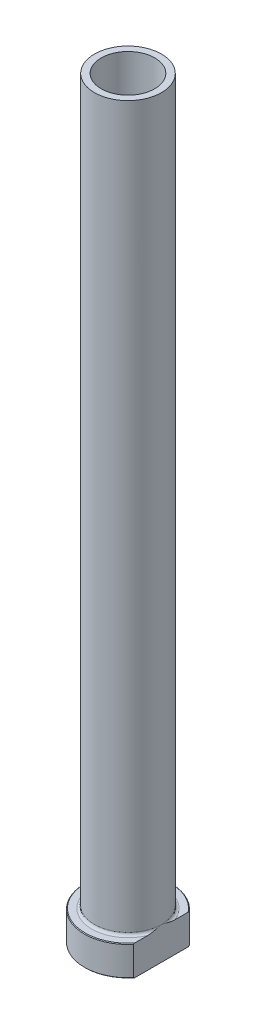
ISO-10303-21;
HEADER;
FILE_DESCRIPTION(('STEP AP214'),'2;1');
FILE_NAME('part.step','',(''),(''),'','','');
FILE_SCHEMA(('AUTOMOTIVE_DESIGN { 1 0 10303 214 1 1 1 1 }'));
ENDSEC;
DATA;
#1=APPLICATION_CONTEXT('core data for automotive mechanical design processes');
#2=APPLICATION_PROTOCOL_DEFINITION('international standard','automotive_design',2000,#1);
#3=PRODUCT_CONTEXT('',#1,'mechanical');
#4=PRODUCT('Part','Part','',(#3));
#5=PRODUCT_RELATED_PRODUCT_CATEGORY('part','',(#4));
#6=PRODUCT_DEFINITION_FORMATION('','',#4);
#7=PRODUCT_DEFINITION_CONTEXT('part definition',#1,'design');
#8=PRODUCT_DEFINITION('design','',#6,#7);
#9=PRODUCT_DEFINITION_SHAPE('','',#8);
#10=(LENGTH_UNIT() NAMED_UNIT(*) SI_UNIT(.MILLI.,.METRE.));
#11=(NAMED_UNIT(*) PLANE_ANGLE_UNIT() SI_UNIT($,.RADIAN.));
#12=(NAMED_UNIT(*) SI_UNIT($,.STERADIAN.) SOLID_ANGLE_UNIT());
#13=UNCERTAINTY_MEASURE_WITH_UNIT(LENGTH_MEASURE(1.E-05),#10,'distance_accuracy_value','');
#14=(GEOMETRIC_REPRESENTATION_CONTEXT(3) GLOBAL_UNCERTAINTY_ASSIGNED_CONTEXT((#13)) GLOBAL_UNIT_ASSIGNED_CONTEXT((#10,
#11,#12)) REPRESENTATION_CONTEXT('',''));
#15=CARTESIAN_POINT('',(0.,0.,0.));
#16=DIRECTION('',(0.,0.,1.));
#17=DIRECTION('',(1.,0.,0.));
#18=AXIS2_PLACEMENT_3D('',#15,#16,#17);
#19=CARTESIAN_POINT('',(0.,92.1876809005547,0.));
#20=DIRECTION('',(0.,1.,0.));
#21=DIRECTION('',(0.,0.,1.));
#22=AXIS2_PLACEMENT_3D('',#19,#20,#21);
#23=CYLINDRICAL_SURFACE('',#22,8.00000000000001);
#24=CARTESIAN_POINT('',(0.,225.,0.));
#25=DIRECTION('',(0.,1.,0.));
#26=DIRECTION('',(0.,0.,1.));
#27=AXIS2_PLACEMENT_3D('',#24,#25,#26);
#28=CIRCLE('',#27,8.00000000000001);
#29=CARTESIAN_POINT('',(0.,225.,8.00000000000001));
#30=VERTEX_POINT('',#29);
#31=EDGE_CURVE('E167',#30,#30,#28,.T.);
#32=ORIENTED_EDGE('',*,*,#31,.T.);
#33=EDGE_LOOP('',(#32));
#34=FACE_BOUND('',#33,.T.);
#35=CARTESIAN_POINT('',(0.,170.,0.));
#36=DIRECTION('',(0.,1.,0.));
#37=DIRECTION('',(0.,0.,1.));
#38=AXIS2_PLACEMENT_3D('',#35,#36,#37);
#39=CIRCLE('',#38,8.00000000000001);
#40=CARTESIAN_POINT('',(0.,170.,8.00000000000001));
#41=VERTEX_POINT('',#40);
#42=EDGE_CURVE('E170',#41,#41,#39,.T.);
#43=ORIENTED_EDGE('',*,*,#42,.F.);
#44=EDGE_LOOP('',(#43));
#45=FACE_BOUND('',#44,.T.);
#46=ADVANCED_FACE('F32',(#34,#45),#23,.F.);
#47=CARTESIAN_POINT('',(-8.00000000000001,225.,0.));
#48=DIRECTION('',(0.,1.,0.));
#49=DIRECTION('',(0.,0.,1.));
#50=AXIS2_PLACEMENT_3D('',#47,#48,#49);
#51=PLANE('',#50);
#52=CARTESIAN_POINT('',(0.,225.,0.));
#53=DIRECTION('',(0.,1.,0.));
#54=DIRECTION('',(0.,0.,1.));
#55=AXIS2_PLACEMENT_3D('',#52,#53,#54);
#56=CIRCLE('',#55,10.);
#57=CARTESIAN_POINT('',(0.,225.,10.));
#58=VERTEX_POINT('',#57);
#59=EDGE_CURVE('E174',#58,#58,#56,.T.);
#60=ORIENTED_EDGE('',*,*,#59,.T.);
#61=EDGE_LOOP('',(#60));
#62=FACE_BOUND('',#61,.T.);
#63=ORIENTED_EDGE('',*,*,#31,.F.);
#64=EDGE_LOOP('',(#63));
#65=FACE_BOUND('',#64,.T.);
#66=ADVANCED_FACE('F157',(#62,#65),#51,.T.);
#67=CARTESIAN_POINT('',(0.,92.1876809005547,0.));
#68=DIRECTION('',(0.,1.,0.));
#69=DIRECTION('',(0.,0.,1.));
#70=AXIS2_PLACEMENT_3D('',#67,#68,#69);
#71=CYLINDRICAL_SURFACE('',#70,10.);
#72=CARTESIAN_POINT('',(0.,9.8,0.));
#73=DIRECTION('',(0.,1.,0.));
#74=DIRECTION('',(0.,0.,1.));
#75=AXIS2_PLACEMENT_3D('',#72,#73,#74);
#76=CIRCLE('',#75,10.);
#77=CARTESIAN_POINT('',(10.,9.8,0.));
#78=VERTEX_POINT('',#77);
#79=EDGE_CURVE('E180',#78,#78,#76,.T.);
#80=ORIENTED_EDGE('',*,*,#79,.T.);
#81=EDGE_LOOP('',(#80));
#82=FACE_BOUND('',#81,.T.);
#83=ORIENTED_EDGE('',*,*,#59,.F.);
#84=EDGE_LOOP('',(#83));
#85=FACE_BOUND('',#84,.T.);
#86=ADVANCED_FACE('F162',(#82,#85),#71,.T.);
#87=CARTESIAN_POINT('',(-9.99999999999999,9.,0.));
#88=DIRECTION('',(0.,1.,0.));
#89=DIRECTION('',(0.,0.,1.));
#90=AXIS2_PLACEMENT_3D('',#87,#88,#89);
#91=PLANE('',#90);
#92=DIRECTION('',(0.,0.,1.));
#93=VECTOR('',#92,1.);
#94=CARTESIAN_POINT('',(10.,9.,0.));
#95=LINE('',#94,#93);
#96=CARTESIAN_POINT('',(10.,9.,-7.98999374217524));
#97=VERTEX_POINT('',#96);
#98=CARTESIAN_POINT('',(10.,9.,-4.07921561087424));
#99=VERTEX_POINT('',#98);
#100=EDGE_CURVE('E54',#97,#99,#95,.T.);
#101=ORIENTED_EDGE('',*,*,#100,.F.);
#102=CARTESIAN_POINT('',(0.,9.,0.));
#103=DIRECTION('',(0.,1.,0.));
#104=DIRECTION('',(0.,0.,1.));
#105=AXIS2_PLACEMENT_3D('',#102,#103,#104);
#106=CIRCLE('',#105,12.8);
#107=CARTESIAN_POINT('',(9.99999999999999,9.,7.98999374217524));
#108=VERTEX_POINT('',#107);
#109=EDGE_CURVE('E186',#97,#108,#106,.T.);
#110=ORIENTED_EDGE('',*,*,#109,.T.);
#111=CARTESIAN_POINT('',(10.,9.,4.07921561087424));
#112=VERTEX_POINT('',#111);
#113=EDGE_CURVE('E134',#112,#108,#95,.T.);
#114=ORIENTED_EDGE('',*,*,#113,.F.);
#115=CARTESIAN_POINT('',(0.,9.,0.));
#116=DIRECTION('',(0.,1.,0.));
#117=DIRECTION('',(0.,0.,1.));
#118=AXIS2_PLACEMENT_3D('',#115,#116,#117);
#119=CIRCLE('',#118,10.8);
#120=EDGE_CURVE('E183',#112,#99,#119,.F.);
#121=ORIENTED_EDGE('',*,*,#120,.T.);
#122=EDGE_LOOP('',(#101,#110,#114,#121));
#123=FACE_BOUND('',#122,.T.);
#124=ADVANCED_FACE('F197',(#123),#91,.T.);
#125=CARTESIAN_POINT('',(0.,92.1876809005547,0.));
#126=DIRECTION('',(0.,1.,0.));
#127=DIRECTION('',(0.,0.,1.));
#128=AXIS2_PLACEMENT_3D('',#125,#126,#127);
#129=CYLINDRICAL_SURFACE('',#128,13.);
#130=DIRECTION('',(0.,-1.,0.));
#131=VECTOR('',#130,1.);
#132=CARTESIAN_POINT('',(9.99999999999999,225.,8.30662386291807));
#133=LINE('',#132,#131);
#134=CARTESIAN_POINT('',(9.99999999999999,8.79999999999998,8.30662386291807));
#135=VERTEX_POINT('',#134);
#136=CARTESIAN_POINT('',(9.99999999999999,0.200000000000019,8.30662386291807));
#137=VERTEX_POINT('',#136);
#138=EDGE_CURVE('E82',#135,#137,#133,.T.);
#139=ORIENTED_EDGE('',*,*,#138,.F.);
#140=CARTESIAN_POINT('',(0.,8.79999999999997,0.));
#141=DIRECTION('',(0.,1.,0.));
#142=DIRECTION('',(0.,0.,1.));
#143=AXIS2_PLACEMENT_3D('',#140,#141,#142);
#144=CIRCLE('',#143,13.);
#145=CARTESIAN_POINT('',(10.,8.79999999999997,-8.30662386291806));
#146=VERTEX_POINT('',#145);
#147=EDGE_CURVE('E95',#135,#146,#144,.F.);
#148=ORIENTED_EDGE('',*,*,#147,.T.);
#149=DIRECTION('',(0.,-1.,0.));
#150=VECTOR('',#149,1.);
#151=CARTESIAN_POINT('',(10.,225.,-8.30662386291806));
#152=LINE('',#151,#150);
#153=CARTESIAN_POINT('',(10.,0.20000000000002,-8.30662386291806));
#154=VERTEX_POINT('',#153);
#155=EDGE_CURVE('E192',#146,#154,#152,.T.);
#156=ORIENTED_EDGE('',*,*,#155,.T.);
#157=CARTESIAN_POINT('',(0.,0.20000000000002,0.));
#158=DIRECTION('',(0.,-1.,0.));
#159=DIRECTION('',(0.,0.,-1.));
#160=AXIS2_PLACEMENT_3D('',#157,#158,#159);
#161=CIRCLE('',#160,13.);
#162=EDGE_CURVE('E98',#154,#137,#161,.F.);
#163=ORIENTED_EDGE('',*,*,#162,.T.);
#164=EDGE_LOOP('',(#139,#148,#156,#163));
#165=FACE_BOUND('',#164,.T.);
#166=ADVANCED_FACE('F190',(#165),#129,.T.);
#167=CARTESIAN_POINT('',(-13.,0.,0.));
#168=DIRECTION('',(0.,-1.,0.));
#169=DIRECTION('',(0.,0.,-1.));
#170=AXIS2_PLACEMENT_3D('',#167,#168,#169);
#171=PLANE('',#170);
#172=CARTESIAN_POINT('',(0.,0.,0.));
#173=DIRECTION('',(0.,-1.,0.));
#174=DIRECTION('',(0.,0.,-1.));
#175=AXIS2_PLACEMENT_3D('',#172,#173,#174);
#176=CIRCLE('',#175,8.74999999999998);
#177=CARTESIAN_POINT('',(0.,0.,-8.74999999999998));
#178=VERTEX_POINT('',#177);
#179=EDGE_CURVE('E40',#178,#178,#176,.F.);
#180=ORIENTED_EDGE('',*,*,#179,.T.);
#181=EDGE_LOOP('',(#180));
#182=FACE_BOUND('',#181,.T.);
#183=DIRECTION('',(0.,0.,-1.));
#184=VECTOR('',#183,1.);
#185=CARTESIAN_POINT('',(9.99999999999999,0.,8.30662386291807));
#186=LINE('',#185,#184);
#187=CARTESIAN_POINT('',(9.99999999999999,0.,7.98999374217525));
#188=VERTEX_POINT('',#187);
#189=CARTESIAN_POINT('',(10.,0.,-7.98999374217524));
#190=VERTEX_POINT('',#189);
#191=EDGE_CURVE('E47',#188,#190,#186,.T.);
#192=ORIENTED_EDGE('',*,*,#191,.F.);
#193=CARTESIAN_POINT('',(0.,0.,0.));
#194=DIRECTION('',(0.,-1.,0.));
#195=DIRECTION('',(0.,0.,-1.));
#196=AXIS2_PLACEMENT_3D('',#193,#194,#195);
#197=CIRCLE('',#196,12.8);
#198=EDGE_CURVE('E92',#188,#190,#197,.T.);
#199=ORIENTED_EDGE('',*,*,#198,.T.);
#200=EDGE_LOOP('',(#192,#199));
#201=FACE_BOUND('',#200,.T.);
#202=ADVANCED_FACE('F91',(#182,#201),#171,.T.);
#203=CARTESIAN_POINT('',(0.,92.1876809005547,0.));
#204=DIRECTION('',(0.,1.,0.));
#205=DIRECTION('',(0.,0.,1.));
#206=AXIS2_PLACEMENT_3D('',#203,#204,#205);
#207=CYLINDRICAL_SURFACE('',#206,8.25);
#208=CARTESIAN_POINT('',(0.,0.499999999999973,0.));
#209=DIRECTION('',(0.,-1.,0.));
#210=DIRECTION('',(0.,0.,-1.));
#211=AXIS2_PLACEMENT_3D('',#208,#209,#210);
#212=CIRCLE('',#211,8.25);
#213=CARTESIAN_POINT('',(0.,0.499999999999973,-8.25));
#214=VERTEX_POINT('',#213);
#215=EDGE_CURVE('E11',#214,#214,#212,.T.);
#216=ORIENTED_EDGE('',*,*,#215,.T.);
#217=EDGE_LOOP('',(#216));
#218=FACE_BOUND('',#217,.T.);
#219=CARTESIAN_POINT('',(0.,158.,0.));
#220=DIRECTION('',(0.,1.,0.));
#221=DIRECTION('',(0.,0.,1.));
#222=AXIS2_PLACEMENT_3D('',#219,#220,#221);
#223=CIRCLE('',#222,8.25000000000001);
#224=CARTESIAN_POINT('',(0.,158.,8.25000000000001));
#225=VERTEX_POINT('',#224);
#226=EDGE_CURVE('E172',#225,#225,#223,.T.);
#227=ORIENTED_EDGE('',*,*,#226,.T.);
#228=EDGE_LOOP('',(#227));
#229=FACE_BOUND('',#228,.T.);
#230=ADVANCED_FACE('F215',(#218,#229),#207,.F.);
#231=CARTESIAN_POINT('',(0.,158.,0.));
#232=DIRECTION('',(0.,-1.,0.));
#233=DIRECTION('',(0.,0.,-1.));
#234=AXIS2_PLACEMENT_3D('',#231,#232,#233);
#235=CONICAL_SURFACE('',#234,8.25000000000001,0.0208303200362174);
#236=ORIENTED_EDGE('',*,*,#42,.T.);
#237=EDGE_LOOP('',(#236));
#238=FACE_BOUND('',#237,.T.);
#239=ORIENTED_EDGE('',*,*,#226,.F.);
#240=EDGE_LOOP('',(#239));
#241=FACE_BOUND('',#240,.T.);
#242=ADVANCED_FACE('F111',(#238,#241),#235,.F.);
#243=CARTESIAN_POINT('',(0.,9.8,0.));
#244=DIRECTION('',(0.,1.,0.));
#245=DIRECTION('',(0.,0.,1.));
#246=AXIS2_PLACEMENT_3D('',#243,#244,#245);
#247=TOROIDAL_SURFACE('',#246,10.8,0.8);
#248=ORIENTED_EDGE('',*,*,#120,.F.);
#249=CARTESIAN_POINT('',(10.,9.8,0.));
#250=CARTESIAN_POINT('',(10.,9.8000010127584,-9.45152350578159E-11));
#251=CARTESIAN_POINT('',(10.,9.80000202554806,3.40325426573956E-07));
#252=CARTESIAN_POINT('',(10.,9.80000393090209,1.31610406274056E-06));
#253=CARTESIAN_POINT('',(10.,9.8000048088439,1.9715863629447E-06));
#254=CARTESIAN_POINT('',(10.,9.80000660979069,3.53741339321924E-06));
#255=CARTESIAN_POINT('',(10.,9.80000751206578,4.47242181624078E-06));
#256=CARTESIAN_POINT('',(10.,9.80000915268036,6.43001227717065E-06));
#257=CARTESIAN_POINT('',(10.,9.80000989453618,7.44984104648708E-06));
#258=CARTESIAN_POINT('',(10.,9.80001258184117,1.13248886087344E-05));
#259=CARTESIAN_POINT('',(10.,9.80001437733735,1.42883369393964E-05));
#260=CARTESIAN_POINT('',(10.,9.80001739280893,2.02176342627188E-05));
#261=CARTESIAN_POINT('',(10.,9.80001864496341,2.31678808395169E-05));
#262=CARTESIAN_POINT('',(10.,9.80002377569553,3.54352080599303E-05));
#263=CARTESIAN_POINT('',(10.,9.8000275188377,4.48168454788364E-05));
#264=CARTESIAN_POINT('',(10.,9.80003314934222,6.2698944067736E-05));
#265=CARTESIAN_POINT('',(10.,9.80003522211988,7.11410842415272E-05));
#266=CARTESIAN_POINT('',(10.,9.80005012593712,0.000133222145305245));
#267=CARTESIAN_POINT('',(10.,9.80006122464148,0.000187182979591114));
#268=CARTESIAN_POINT('',(9.99999999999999,9.80010979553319,0.000399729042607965));
#269=CARTESIAN_POINT('',(9.99999999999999,9.8001563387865,0.000556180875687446));
#270=CARTESIAN_POINT('',(10.,9.80033693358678,0.00117428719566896));
#271=CARTESIAN_POINT('',(10.,9.80046495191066,0.00163717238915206));
#272=CARTESIAN_POINT('',(9.99999999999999,9.80097646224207,0.0034721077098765));
#273=CARTESIAN_POINT('',(9.99999999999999,9.80136744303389,0.0048425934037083));
#274=CARTESIAN_POINT('',(10.,9.80299279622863,0.0105557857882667));
#275=CARTESIAN_POINT('',(10.,9.80421787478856,0.0149004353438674));
#276=CARTESIAN_POINT('',(9.99999999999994,9.82556128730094,0.0905719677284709));
#277=CARTESIAN_POINT('',(9.99999999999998,9.84576707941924,0.161880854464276));
#278=CARTESIAN_POINT('',(10.,9.88522005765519,0.301650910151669));
#279=CARTESIAN_POINT('',(10.,9.90447296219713,0.370110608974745));
#280=CARTESIAN_POINT('',(9.99999999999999,9.94526885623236,0.515796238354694));
#281=CARTESIAN_POINT('',(9.99999999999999,9.96679118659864,0.593028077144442));
#282=CARTESIAN_POINT('',(10.,10.0097481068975,0.748439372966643));
#283=CARTESIAN_POINT('',(9.99999999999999,10.0311790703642,0.826619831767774));
#284=CARTESIAN_POINT('',(9.99999999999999,10.0674480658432,0.960424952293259));
#285=CARTESIAN_POINT('',(9.99999999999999,10.0823966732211,1.0160196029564));
#286=CARTESIAN_POINT('',(9.99999999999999,10.1119856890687,1.12713670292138));
#287=CARTESIAN_POINT('',(9.99999999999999,10.1266267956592,1.18265896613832));
#288=CARTESIAN_POINT('',(9.99999999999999,10.169346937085,1.34653602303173));
#289=CARTESIAN_POINT('',(9.99999999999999,10.196987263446,1.45500531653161));
#290=CARTESIAN_POINT('',(9.99999999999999,10.2756989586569,1.77328068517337));
#291=CARTESIAN_POINT('',(9.99999999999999,10.324682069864,1.98361173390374));
#292=CARTESIAN_POINT('',(9.99999999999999,10.4145276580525,2.40819632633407));
#293=CARTESIAN_POINT('',(9.99999999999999,10.4553067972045,2.62246812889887));
#294=CARTESIAN_POINT('',(9.99999999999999,10.5084820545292,2.95416694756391));
#295=CARTESIAN_POINT('',(9.99999999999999,10.5253125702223,3.0708804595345));
#296=CARTESIAN_POINT('',(9.99999999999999,10.5545282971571,3.30485600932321));
#297=CARTESIAN_POINT('',(9.99999999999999,10.566914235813,3.42211795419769));
#298=CARTESIAN_POINT('',(9.99999999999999,10.5862669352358,3.65666308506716));
#299=CARTESIAN_POINT('',(9.99999999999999,10.5932535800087,3.77394458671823));
#300=CARTESIAN_POINT('',(9.99999999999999,10.6006869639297,4.0086962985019));
#301=CARTESIAN_POINT('',(9.99999999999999,10.601136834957,4.12616639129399));
#302=CARTESIAN_POINT('',(9.99999999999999,10.5953428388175,4.31342169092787));
#303=CARTESIAN_POINT('',(9.99999999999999,10.5917310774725,4.38328917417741));
#304=CARTESIAN_POINT('',(9.99999999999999,10.5811472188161,4.52281815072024));
#305=CARTESIAN_POINT('',(9.99999999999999,10.574173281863,4.59247951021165));
#306=CARTESIAN_POINT('',(9.99999999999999,10.5564119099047,4.73037447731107));
#307=CARTESIAN_POINT('',(9.99999999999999,10.5456769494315,4.79861469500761));
#308=CARTESIAN_POINT('',(9.99999999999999,10.5196644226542,4.93420158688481));
#309=CARTESIAN_POINT('',(9.99999999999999,10.5043897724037,5.0015488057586));
#310=CARTESIAN_POINT('',(9.99999999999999,10.4686666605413,5.13352311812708));
#311=CARTESIAN_POINT('',(9.99999999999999,10.4483210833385,5.19817755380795));
#312=CARTESIAN_POINT('',(9.99999999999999,10.4009719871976,5.32529278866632));
#313=CARTESIAN_POINT('',(9.99999999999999,10.3739509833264,5.38774732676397));
#314=CARTESIAN_POINT('',(9.99999999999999,10.3179612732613,5.49580578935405));
#315=CARTESIAN_POINT('',(9.99999999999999,10.2905647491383,5.54221397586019));
#316=CARTESIAN_POINT('',(9.99999999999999,10.2292665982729,5.63051146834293));
#317=CARTESIAN_POINT('',(9.99999999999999,10.1953873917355,5.67241559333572));
#318=CARTESIAN_POINT('',(9.99999999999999,10.1360154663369,5.73223475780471));
#319=CARTESIAN_POINT('',(9.99999999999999,10.1131443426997,5.75273814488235));
#320=CARTESIAN_POINT('',(9.99999999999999,10.0646870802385,5.79027658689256));
#321=CARTESIAN_POINT('',(9.99999999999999,10.0391039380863,5.80731541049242));
#322=CARTESIAN_POINT('',(9.99999999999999,9.98994373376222,5.83419675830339));
#323=CARTESIAN_POINT('',(9.99999999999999,9.96677157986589,5.84477159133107));
#324=CARTESIAN_POINT('',(9.99999999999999,9.91898778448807,5.86193670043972));
#325=CARTESIAN_POINT('',(9.99999999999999,9.89437752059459,5.86853072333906));
#326=CARTESIAN_POINT('',(9.99999999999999,9.84418742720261,5.87715396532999));
#327=CARTESIAN_POINT('',(9.99999999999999,9.81860236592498,5.87915345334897));
#328=CARTESIAN_POINT('',(9.99999999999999,9.76751621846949,5.87827849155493));
#329=CARTESIAN_POINT('',(9.99999999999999,9.74201513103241,5.875404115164));
#330=CARTESIAN_POINT('',(9.99999999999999,9.69447122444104,5.86561186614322));
#331=CARTESIAN_POINT('',(9.99999999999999,9.67233673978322,5.85912467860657));
#332=CARTESIAN_POINT('',(9.99999999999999,9.62928622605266,5.84294549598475));
#333=CARTESIAN_POINT('',(9.99999999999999,9.60837061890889,5.83325239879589));
#334=CARTESIAN_POINT('',(9.99999999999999,9.5577512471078,5.80562934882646));
#335=CARTESIAN_POINT('',(9.99999999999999,9.52896866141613,5.78601496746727));
#336=CARTESIAN_POINT('',(9.99999999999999,9.47483709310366,5.74250484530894));
#337=CARTESIAN_POINT('',(9.99999999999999,9.44949830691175,5.71859685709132));
#338=CARTESIAN_POINT('',(9.99999999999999,9.38678668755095,5.65152127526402));
#339=CARTESIAN_POINT('',(9.99999999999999,9.35212570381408,5.60583966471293));
#340=CARTESIAN_POINT('',(9.99999999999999,9.28986683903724,5.5100352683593));
#341=CARTESIAN_POINT('',(9.99999999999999,9.26227706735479,5.45990747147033));
#342=CARTESIAN_POINT('',(9.99999999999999,9.21352893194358,5.35857320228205));
#343=CARTESIAN_POINT('',(9.99999999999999,9.19219756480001,5.30744846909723));
#344=CARTESIAN_POINT('',(9.99999999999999,9.15389270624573,5.203566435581));
#345=CARTESIAN_POINT('',(9.99999999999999,9.13692358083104,5.15080755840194));
#346=CARTESIAN_POINT('',(9.99999999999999,9.10650525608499,5.04374335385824));
#347=CARTESIAN_POINT('',(9.99999999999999,9.0930920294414,4.98942795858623));
#348=CARTESIAN_POINT('',(9.99999999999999,9.06945537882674,4.88015209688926));
#349=CARTESIAN_POINT('',(9.99999999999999,9.05923014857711,4.82519201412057));
#350=CARTESIAN_POINT('',(9.99999999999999,9.03790959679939,4.69233768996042));
#351=CARTESIAN_POINT('',(9.99999999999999,9.02815913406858,4.61422851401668));
#352=CARTESIAN_POINT('',(9.99999999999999,9.01316101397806,4.45756553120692));
#353=CARTESIAN_POINT('',(9.99999999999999,9.00791538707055,4.37901153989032));
#354=CARTESIAN_POINT('',(9.99999999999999,9.00123064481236,4.22151967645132));
#355=CARTESIAN_POINT('',(9.99999999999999,8.99980268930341,4.1425813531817));
#356=CARTESIAN_POINT('',(9.99999999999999,9.00024040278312,3.98470913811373));
#357=CARTESIAN_POINT('',(9.99999999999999,9.00210664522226,3.90577524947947));
#358=CARTESIAN_POINT('',(9.99999999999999,9.01166159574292,3.67658822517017));
#359=CARTESIAN_POINT('',(9.99999999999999,9.02309279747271,3.52648869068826));
#360=CARTESIAN_POINT('',(9.99999999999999,9.0538391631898,3.22814233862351));
#361=CARTESIAN_POINT('',(9.99999999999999,9.07310229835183,3.07988982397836));
#362=CARTESIAN_POINT('',(9.99999999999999,9.11140365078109,2.82685899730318));
#363=CARTESIAN_POINT('',(9.99999999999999,9.12891226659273,2.72184373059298));
#364=CARTESIAN_POINT('',(9.99999999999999,9.16657816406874,2.5123603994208));
#365=CARTESIAN_POINT('',(9.99999999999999,9.18673375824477,2.40789203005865));
#366=CARTESIAN_POINT('',(9.99999999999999,9.2297821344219,2.19691696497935));
#367=CARTESIAN_POINT('',(9.99999999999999,9.2527289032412,2.0904213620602));
#368=CARTESIAN_POINT('',(9.99999999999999,9.30061762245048,1.87758593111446));
#369=CARTESIAN_POINT('',(9.99999999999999,9.32556469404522,1.77124726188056));
#370=CARTESIAN_POINT('',(9.99999999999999,9.38672050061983,1.51899805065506));
#371=CARTESIAN_POINT('',(9.99999999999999,9.42363361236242,1.37325886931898));
#372=CARTESIAN_POINT('',(9.99999999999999,9.49915836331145,1.08396245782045));
#373=CARTESIAN_POINT('',(9.99999999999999,9.53774645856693,0.940399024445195));
#374=CARTESIAN_POINT('',(9.99999999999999,9.59435075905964,0.733594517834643));
#375=CARTESIAN_POINT('',(10.,9.6118385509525,0.670207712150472));
#376=CARTESIAN_POINT('',(9.99999999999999,9.64708788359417,0.543216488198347));
#377=CARTESIAN_POINT('',(9.99999999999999,9.66485027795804,0.479612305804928));
#378=CARTESIAN_POINT('',(10.,9.70136722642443,0.349337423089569));
#379=CARTESIAN_POINT('',(10.,9.72012791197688,0.282668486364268));
#380=CARTESIAN_POINT('',(9.99999999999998,9.75747272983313,0.150420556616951));
#381=CARTESIAN_POINT('',(9.99999999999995,9.77605493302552,0.0848410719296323));
#382=CARTESIAN_POINT('',(10.,9.79578310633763,0.014897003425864));
#383=CARTESIAN_POINT('',(10.,9.79700913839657,0.0105489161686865));
#384=CARTESIAN_POINT('',(9.99999999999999,9.79863471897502,0.00483493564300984));
#385=CARTESIAN_POINT('',(9.99999999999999,9.79902494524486,0.00346709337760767));
#386=CARTESIAN_POINT('',(10.,9.79953553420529,0.00163546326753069));
#387=CARTESIAN_POINT('',(10.,9.79966336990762,0.00117323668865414));
#388=CARTESIAN_POINT('',(9.99999999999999,9.7998437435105,0.000555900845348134));
#389=CARTESIAN_POINT('',(9.99999999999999,9.79989025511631,0.000399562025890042));
#390=CARTESIAN_POINT('',(10.,9.79993879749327,0.00018714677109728));
#391=CARTESIAN_POINT('',(10.,9.79994989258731,0.000133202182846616));
#392=CARTESIAN_POINT('',(10.,9.79996478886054,7.11376109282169E-05));
#393=CARTESIAN_POINT('',(10.,9.79996686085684,6.26964097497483E-05));
#394=CARTESIAN_POINT('',(10.,9.79997248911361,4.4816203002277E-05));
#395=CARTESIAN_POINT('',(10.,9.79997623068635,3.54354689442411E-05));
#396=CARTESIAN_POINT('',(10.,9.7999813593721,2.31690667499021E-05));
#397=CARTESIAN_POINT('',(10.,9.79998261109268,2.02188903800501E-05));
#398=CARTESIAN_POINT('',(10.,9.79998562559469,1.42896588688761E-05));
#399=CARTESIAN_POINT('',(10.,9.7999874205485,1.1326198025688E-05));
#400=CARTESIAN_POINT('',(10.,9.79999010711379,7.45104590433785E-06));
#401=CARTESIAN_POINT('',(10.,9.79999084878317,6.43116651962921E-06));
#402=CARTESIAN_POINT('',(10.,9.79999248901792,4.47344118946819E-06));
#403=CARTESIAN_POINT('',(10.,9.79999339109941,3.53834752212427E-06));
#404=CARTESIAN_POINT('',(10.,9.79999519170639,1.97231862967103E-06));
#405=CARTESIAN_POINT('',(10.,9.79999606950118,1.31672665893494E-06));
#406=CARTESIAN_POINT('',(10.,9.79999797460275,3.40673802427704E-07));
#407=CARTESIAN_POINT('',(10.,9.79999898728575,9.45152917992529E-11));
#408=CARTESIAN_POINT('',(10.,9.8,0.));
#409=B_SPLINE_CURVE_WITH_KNOTS('',3,(#249,#250,#251,#252,#253,#254,#255,#256,#257,#258,#259,
#260,#261,#262,#263,#264,#265,#266,#267,#268,#269,#270,#271,#272,#273,#274,#275,#276,#277,#278,
#279,#280,#281,#282,#283,#284,#285,#286,#287,#288,#289,#290,#291,#292,#293,#294,#295,#296,#297,
#298,#299,#300,#301,#302,#303,#304,#305,#306,#307,#308,#309,#310,#311,#312,#313,#314,#315,#316,
#317,#318,#319,#320,#321,#322,#323,#324,#325,#326,#327,#328,#329,#330,#331,#332,#333,#334,#335,
#336,#337,#338,#339,#340,#341,#342,#343,#344,#345,#346,#347,#348,#349,#350,#351,#352,#353,#354,
#355,#356,#357,#358,#359,#360,#361,#362,#363,#364,#365,#366,#367,#368,#369,#370,#371,#372,#373,
#374,#375,#376,#377,#378,#379,#380,#381,#382,#383,#384,#385,#386,#387,#388,#389,#390,#391,#392,
#393,#394,#395,#396,#397,#398,#399,#400,#401,#402,#403,#404,#405,#406,#407,#408),.UNSPECIFIED.,
.T.,.F.,(4,2,2,2,2,2,2,2,2,2,2,2,2,2,2,2,2,2,2,2,2,2,2,2,2,2,2,2,2,2,2,2,2,2,2,2,2,2,2,2,2,2,2,
2,2,2,2,2,2,2,2,2,2,2,2,2,2,2,2,2,2,2,2,2,2,2,2,2,2,2,2,2,2,2,2,2,2,2,2,4),(0.,
3.05351338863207E-06,6.33501482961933E-06,1.02119585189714E-05,1.39925695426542E-05,
2.43463996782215E-05,3.39531380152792E-05,6.41940053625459E-05,9.02394261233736E-05,
0.000255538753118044,0.000744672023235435,0.00218601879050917,0.00646083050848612,
0.0200037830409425,0.242344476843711,0.455692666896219,0.696215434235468,0.939408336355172,
1.11211570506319,1.28437564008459,1.62017633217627,2.26794742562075,2.9219989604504,
3.27569508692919,3.62933329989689,3.98166287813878,4.33382364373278,4.54364126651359,
4.75357382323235,4.96068691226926,5.16766724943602,5.37074850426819,5.57436743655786,
5.73566415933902,5.89641280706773,5.98832296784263,6.08013260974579,6.15624455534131,
6.23228475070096,6.3088156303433,6.38534535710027,6.45426203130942,6.52320242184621,
6.62709802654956,6.73129483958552,6.90235535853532,7.07361118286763,7.23955286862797,
7.40565999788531,7.57338840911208,7.74102161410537,7.97699807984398,8.2130808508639,
8.44985298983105,8.68666634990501,9.13795683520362,9.58629707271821,9.90565495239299,
10.2248102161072,10.5516078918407,10.8792707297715,11.3302696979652,11.7762371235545,
11.9735018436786,12.1716145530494,12.3793913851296,12.583867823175,12.5974214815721,
12.6016880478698,12.6031273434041,12.6036161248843,12.6037813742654,12.6038074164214,
12.6038376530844,12.6038472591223,12.6038576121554,12.6038613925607,12.6038652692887,
12.6038685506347,12.603871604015),.UNSPECIFIED.);
#410=EDGE_CURVE('E126',#112,#78,#409,.T.);
#411=ORIENTED_EDGE('',*,*,#410,.T.);
#412=ORIENTED_EDGE('',*,*,#79,.F.);
#413=CARTESIAN_POINT('',(10.,9.8,0.));
#414=CARTESIAN_POINT('',(10.,9.7999989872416,9.45196026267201E-11));
#415=CARTESIAN_POINT('',(10.,9.79999797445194,-3.40325422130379E-07));
#416=CARTESIAN_POINT('',(10.,9.79999606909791,-1.31610405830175E-06));
#417=CARTESIAN_POINT('',(10.,9.7999951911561,-1.97158635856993E-06));
#418=CARTESIAN_POINT('',(10.,9.79999339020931,-3.53741338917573E-06));
#419=CARTESIAN_POINT('',(10.,9.79999248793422,-4.47242181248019E-06));
#420=CARTESIAN_POINT('',(10.,9.79999084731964,-6.43001227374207E-06));
#421=CARTESIAN_POINT('',(10.,9.79999010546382,-7.44984104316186E-06));
#422=CARTESIAN_POINT('',(10.,9.79998741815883,-1.13248886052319E-05));
#423=CARTESIAN_POINT('',(10.,9.79998562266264,-1.4288336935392E-05));
#424=CARTESIAN_POINT('',(10.,9.79998260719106,-2.0217634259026E-05));
#425=CARTESIAN_POINT('',(10.,9.79998135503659,-2.31678808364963E-05));
#426=CARTESIAN_POINT('',(10.,9.79997622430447,-3.54352080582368E-05));
#427=CARTESIAN_POINT('',(10.,9.79997248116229,-4.48168454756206E-05));
#428=CARTESIAN_POINT('',(10.,9.79996685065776,-6.26989440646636E-05));
#429=CARTESIAN_POINT('',(10.,9.7999647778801,-7.11410842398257E-05));
#430=CARTESIAN_POINT('',(10.,9.79994987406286,-0.000133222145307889));
#431=CARTESIAN_POINT('',(10.,9.79993877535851,-0.000187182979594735));
#432=CARTESIAN_POINT('',(9.99999999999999,9.7998902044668,-0.000399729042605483));
#433=CARTESIAN_POINT('',(9.99999999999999,9.7998436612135,-0.000556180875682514));
#434=CARTESIAN_POINT('',(10.,9.79966306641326,-0.00117428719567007));
#435=CARTESIAN_POINT('',(10.,9.79953504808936,-0.00163717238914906));
#436=CARTESIAN_POINT('',(9.99999999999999,9.79902353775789,-0.00347210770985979));
#437=CARTESIAN_POINT('',(9.99999999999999,9.7986325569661,-0.00484259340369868));
#438=CARTESIAN_POINT('',(10.,9.79700720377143,-0.0105557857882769));
#439=CARTESIAN_POINT('',(10.,9.79578212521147,-0.01490043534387));
#440=CARTESIAN_POINT('',(9.99999999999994,9.77443871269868,-0.0905719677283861));
#441=CARTESIAN_POINT('',(9.99999999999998,9.75423292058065,-0.161880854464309));
#442=CARTESIAN_POINT('',(10.,9.7147799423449,-0.301650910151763));
#443=CARTESIAN_POINT('',(10.,9.6955270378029,-0.370110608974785));
#444=CARTESIAN_POINT('',(9.99999999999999,9.65473114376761,-0.515796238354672));
#445=CARTESIAN_POINT('',(9.99999999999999,9.63320881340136,-0.593028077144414));
#446=CARTESIAN_POINT('',(10.,9.59025189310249,-0.748439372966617));
#447=CARTESIAN_POINT('',(9.99999999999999,9.56882092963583,-0.826619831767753));
#448=CARTESIAN_POINT('',(9.99999999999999,9.53255193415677,-0.960424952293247));
#449=CARTESIAN_POINT('',(9.99999999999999,9.51760332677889,-1.01601960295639));
#450=CARTESIAN_POINT('',(9.99999999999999,9.48801431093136,-1.12713670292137));
#451=CARTESIAN_POINT('',(9.99999999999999,9.4733732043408,-1.18265896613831));
#452=CARTESIAN_POINT('',(9.99999999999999,9.43065306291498,-1.34653602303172));
#453=CARTESIAN_POINT('',(9.99999999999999,9.40301273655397,-1.4550053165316));
#454=CARTESIAN_POINT('',(9.99999999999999,9.32430104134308,-1.77328068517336));
#455=CARTESIAN_POINT('',(9.99999999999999,9.27531793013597,-1.98361173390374));
#456=CARTESIAN_POINT('',(9.99999999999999,9.18547234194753,-2.40819632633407));
#457=CARTESIAN_POINT('',(9.99999999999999,9.14469320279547,-2.62246812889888));
#458=CARTESIAN_POINT('',(9.99999999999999,9.09151794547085,-2.95416694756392));
#459=CARTESIAN_POINT('',(9.99999999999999,9.07468742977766,-3.0708804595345));
#460=CARTESIAN_POINT('',(9.99999999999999,9.04547170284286,-3.30485600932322));
#461=CARTESIAN_POINT('',(9.99999999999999,9.03308576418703,-3.42211795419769));
#462=CARTESIAN_POINT('',(9.99999999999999,9.01373306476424,-3.65666308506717));
#463=CARTESIAN_POINT('',(9.99999999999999,9.00674641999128,-3.77394458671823));
#464=CARTESIAN_POINT('',(9.99999999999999,8.99931303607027,-4.00869629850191));
#465=CARTESIAN_POINT('',(10.,8.99886316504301,-4.12616639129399));
#466=CARTESIAN_POINT('',(10.,9.00465716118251,-4.31342169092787));
#467=CARTESIAN_POINT('',(10.,9.00826892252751,-4.38328917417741));
#468=CARTESIAN_POINT('',(10.,9.01885278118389,-4.52281815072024));
#469=CARTESIAN_POINT('',(10.,9.02582671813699,-4.59247951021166));
#470=CARTESIAN_POINT('',(10.,9.0435880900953,-4.73037447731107));
#471=CARTESIAN_POINT('',(10.,9.05432305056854,-4.79861469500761));
#472=CARTESIAN_POINT('',(10.,9.08033557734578,-4.93420158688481));
#473=CARTESIAN_POINT('',(10.,9.09561022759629,-5.0015488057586));
#474=CARTESIAN_POINT('',(10.,9.13133333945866,-5.13352311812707));
#475=CARTESIAN_POINT('',(10.,9.15167891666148,-5.19817755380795));
#476=CARTESIAN_POINT('',(10.,9.19902801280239,-5.32529278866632));
#477=CARTESIAN_POINT('',(10.,9.22604901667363,-5.38774732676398));
#478=CARTESIAN_POINT('',(10.,9.28203872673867,-5.49580578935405));
#479=CARTESIAN_POINT('',(10.,9.30943525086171,-5.54221397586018));
#480=CARTESIAN_POINT('',(10.,9.37073340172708,-5.63051146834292));
#481=CARTESIAN_POINT('',(10.,9.40461260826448,-5.67241559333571));
#482=CARTESIAN_POINT('',(10.,9.46398453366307,-5.73223475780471));
#483=CARTESIAN_POINT('',(10.,9.48685565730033,-5.75273814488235));
#484=CARTESIAN_POINT('',(10.,9.53531291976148,-5.79027658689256));
#485=CARTESIAN_POINT('',(10.,9.56089606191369,-5.80731541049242));
#486=CARTESIAN_POINT('',(10.,9.61005626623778,-5.83419675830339));
#487=CARTESIAN_POINT('',(10.,9.63322842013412,-5.84477159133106));
#488=CARTESIAN_POINT('',(10.,9.68101221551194,-5.86193670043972));
#489=CARTESIAN_POINT('',(10.,9.70562247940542,-5.86853072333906));
#490=CARTESIAN_POINT('',(10.,9.75581257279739,-5.87715396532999));
#491=CARTESIAN_POINT('',(10.,9.78139763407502,-5.87915345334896));
#492=CARTESIAN_POINT('',(10.,9.83248378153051,-5.87827849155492));
#493=CARTESIAN_POINT('',(10.,9.8579848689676,-5.875404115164));
#494=CARTESIAN_POINT('',(10.,9.90552877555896,-5.86561186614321));
#495=CARTESIAN_POINT('',(10.,9.92766326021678,-5.85912467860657));
#496=CARTESIAN_POINT('',(10.,9.97071377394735,-5.84294549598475));
#497=CARTESIAN_POINT('',(10.,9.99162938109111,-5.83325239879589));
#498=CARTESIAN_POINT('',(10.,10.0422487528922,-5.80562934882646));
#499=CARTESIAN_POINT('',(10.,10.0710313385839,-5.78601496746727));
#500=CARTESIAN_POINT('',(10.,10.1251629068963,-5.74250484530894));
#501=CARTESIAN_POINT('',(10.,10.1505016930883,-5.71859685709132));
#502=CARTESIAN_POINT('',(10.,10.2132133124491,-5.65152127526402));
#503=CARTESIAN_POINT('',(10.,10.2478742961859,-5.60583966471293));
#504=CARTESIAN_POINT('',(10.,10.3101331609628,-5.51003526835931));
#505=CARTESIAN_POINT('',(10.,10.3377229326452,-5.45990747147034));
#506=CARTESIAN_POINT('',(10.,10.3864710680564,-5.35857320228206));
#507=CARTESIAN_POINT('',(10.,10.4078024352,-5.30744846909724));
#508=CARTESIAN_POINT('',(10.,10.4461072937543,-5.20356643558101));
#509=CARTESIAN_POINT('',(10.,10.463076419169,-5.15080755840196));
#510=CARTESIAN_POINT('',(10.,10.493494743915,-5.04374335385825));
#511=CARTESIAN_POINT('',(10.,10.5069079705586,-4.98942795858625));
#512=CARTESIAN_POINT('',(10.,10.5305446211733,-4.88015209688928));
#513=CARTESIAN_POINT('',(10.,10.5407698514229,-4.82519201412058));
#514=CARTESIAN_POINT('',(10.,10.5620904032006,-4.69233768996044));
#515=CARTESIAN_POINT('',(10.,10.5718408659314,-4.6142285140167));
#516=CARTESIAN_POINT('',(10.,10.5868389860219,-4.45756553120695));
#517=CARTESIAN_POINT('',(10.,10.5920846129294,-4.37901153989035));
#518=CARTESIAN_POINT('',(10.,10.5987693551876,-4.22151967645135));
#519=CARTESIAN_POINT('',(9.99999999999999,10.6001973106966,-4.14258135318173));
#520=CARTESIAN_POINT('',(9.99999999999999,10.5997595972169,-3.98470913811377));
#521=CARTESIAN_POINT('',(9.99999999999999,10.5978933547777,-3.90577524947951));
#522=CARTESIAN_POINT('',(9.99999999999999,10.5883384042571,-3.67658822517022));
#523=CARTESIAN_POINT('',(9.99999999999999,10.5769072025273,-3.52648869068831));
#524=CARTESIAN_POINT('',(9.99999999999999,10.5461608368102,-3.22814233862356));
#525=CARTESIAN_POINT('',(9.99999999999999,10.5268977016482,-3.07988982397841));
#526=CARTESIAN_POINT('',(9.99999999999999,10.4885963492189,-2.82685899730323));
#527=CARTESIAN_POINT('',(9.99999999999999,10.4710877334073,-2.72184373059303));
#528=CARTESIAN_POINT('',(9.99999999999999,10.4334218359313,-2.51236039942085));
#529=CARTESIAN_POINT('',(9.99999999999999,10.4132662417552,-2.4078920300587));
#530=CARTESIAN_POINT('',(9.99999999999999,10.3702178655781,-2.1969169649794));
#531=CARTESIAN_POINT('',(9.99999999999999,10.3472710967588,-2.09042136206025));
#532=CARTESIAN_POINT('',(9.99999999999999,10.2993823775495,-1.8775859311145));
#533=CARTESIAN_POINT('',(9.99999999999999,10.2744353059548,-1.7712472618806));
#534=CARTESIAN_POINT('',(9.99999999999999,10.2132794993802,-1.51899805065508));
#535=CARTESIAN_POINT('',(9.99999999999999,10.1763663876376,-1.37325886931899));
#536=CARTESIAN_POINT('',(9.99999999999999,10.1008416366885,-1.08396245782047));
#537=CARTESIAN_POINT('',(9.99999999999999,10.062253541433,-0.940399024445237));
#538=CARTESIAN_POINT('',(9.99999999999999,10.0056492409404,-0.733594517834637));
#539=CARTESIAN_POINT('',(10.,9.98816144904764,-0.670207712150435));
#540=CARTESIAN_POINT('',(9.99999999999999,9.95291211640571,-0.543216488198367));
#541=CARTESIAN_POINT('',(9.99999999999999,9.93514972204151,-0.479612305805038));
#542=CARTESIAN_POINT('',(10.,9.89863277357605,-0.349337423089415));
#543=CARTESIAN_POINT('',(10.,9.87987208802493,-0.282668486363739));
#544=CARTESIAN_POINT('',(9.99999999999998,9.84252727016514,-0.15042055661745));
#545=CARTESIAN_POINT('',(9.99999999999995,9.82394506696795,-0.0848410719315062));
#546=CARTESIAN_POINT('',(10.,9.80421689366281,-0.0148970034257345));
#547=CARTESIAN_POINT('',(10.,9.80299086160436,-0.0105489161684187));
#548=CARTESIAN_POINT('',(9.99999999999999,9.8013652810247,-0.00483493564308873));
#549=CARTESIAN_POINT('',(9.99999999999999,9.80097505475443,-0.00346709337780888));
#550=CARTESIAN_POINT('',(10.,9.80046446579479,-0.00163546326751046));
#551=CARTESIAN_POINT('',(10.,9.80033663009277,-0.00117323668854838));
#552=CARTESIAN_POINT('',(9.99999999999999,9.80015625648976,-0.000555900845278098));
#553=CARTESIAN_POINT('',(9.99999999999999,9.80010974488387,-0.000399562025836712));
#554=CARTESIAN_POINT('',(10.,9.80006120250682,-0.000187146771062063));
#555=CARTESIAN_POINT('',(10.,9.80005010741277,-0.000133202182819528));
#556=CARTESIAN_POINT('',(10.,9.80003521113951,-7.11376109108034E-05));
#557=CARTESIAN_POINT('',(10.,9.80003313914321,-6.26964097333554E-05));
#558=CARTESIAN_POINT('',(10.,9.80002751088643,-4.48162029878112E-05));
#559=CARTESIAN_POINT('',(10.,9.80002376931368,-3.54354689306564E-05));
#560=CARTESIAN_POINT('',(10.,9.80001864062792,-2.3169066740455E-05));
#561=CARTESIAN_POINT('',(10.,9.80001738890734,-2.02188903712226E-05));
#562=CARTESIAN_POINT('',(10.,9.80001437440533,-1.42896588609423E-05));
#563=CARTESIAN_POINT('',(10.,9.80001257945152,-1.13261980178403E-05));
#564=CARTESIAN_POINT('',(10.,9.80000989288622,-7.45104589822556E-06));
#565=CARTESIAN_POINT('',(10.,9.80000915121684,-6.43116651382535E-06));
#566=CARTESIAN_POINT('',(10.,9.8000075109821,-4.47344118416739E-06));
#567=CARTESIAN_POINT('',(10.,9.80000660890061,-3.53834751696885E-06));
#568=CARTESIAN_POINT('',(10.,9.80000480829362,-1.972318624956E-06));
#569=CARTESIAN_POINT('',(10.,9.80000393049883,-1.31672665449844E-06));
#570=CARTESIAN_POINT('',(10.,9.80000202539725,-3.40673798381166E-07));
#571=CARTESIAN_POINT('',(10.,9.80000101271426,-9.45113058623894E-11));
#572=CARTESIAN_POINT('',(10.,9.8,0.));
#573=B_SPLINE_CURVE_WITH_KNOTS('',3,(#413,#414,#415,#416,#417,#418,#419,#420,#421,#422,#423,
#424,#425,#426,#427,#428,#429,#430,#431,#432,#433,#434,#435,#436,#437,#438,#439,#440,#441,#442,
#443,#444,#445,#446,#447,#448,#449,#450,#451,#452,#453,#454,#455,#456,#457,#458,#459,#460,#461,
#462,#463,#464,#465,#466,#467,#468,#469,#470,#471,#472,#473,#474,#475,#476,#477,#478,#479,#480,
#481,#482,#483,#484,#485,#486,#487,#488,#489,#490,#491,#492,#493,#494,#495,#496,#497,#498,#499,
#500,#501,#502,#503,#504,#505,#506,#507,#508,#509,#510,#511,#512,#513,#514,#515,#516,#517,#518,
#519,#520,#521,#522,#523,#524,#525,#526,#527,#528,#529,#530,#531,#532,#533,#534,#535,#536,#537,
#538,#539,#540,#541,#542,#543,#544,#545,#546,#547,#548,#549,#550,#551,#552,#553,#554,#555,#556,
#557,#558,#559,#560,#561,#562,#563,#564,#565,#566,#567,#568,#569,#570,#571,#572),.UNSPECIFIED.,
.T.,.F.,(4,2,2,2,2,2,2,2,2,2,2,2,2,2,2,2,2,2,2,2,2,2,2,2,2,2,2,2,2,2,2,2,2,2,2,2,2,2,2,2,2,2,2,
2,2,2,2,2,2,2,2,2,2,2,2,2,2,2,2,2,2,2,2,2,2,2,2,2,2,2,2,2,2,2,2,2,2,2,2,4),(0.,
3.0535133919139E-06,6.33501483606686E-06,1.02119585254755E-05,1.39925695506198E-05,
2.43463996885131E-05,3.39531380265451E-05,6.41940053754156E-05,9.02394261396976E-05,
0.000255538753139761,0.000744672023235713,0.00218601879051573,0.00646083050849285,
0.0200037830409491,0.242344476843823,0.455692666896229,0.696215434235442,0.939408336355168,
1.11211570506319,1.28437564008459,1.62017633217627,2.26794742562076,2.92199896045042,
3.27569508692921,3.62933329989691,3.98166287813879,4.3338236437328,4.5436412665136,
4.75357382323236,4.96068691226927,5.16766724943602,5.3707485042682,5.57436743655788,
5.73566415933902,5.89641280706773,5.98832296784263,6.0801326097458,6.15624455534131,
6.23228475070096,6.3088156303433,6.38534535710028,6.45426203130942,6.52320242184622,
6.62709802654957,6.73129483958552,6.90235535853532,7.07361118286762,7.23955286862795,
7.40565999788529,7.57338840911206,7.74102161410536,7.97699807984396,8.21308085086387,
8.44985298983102,8.68666634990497,9.13795683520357,9.58629707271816,9.90565495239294,
10.2248102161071,10.5516078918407,10.8792707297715,11.3302696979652,11.7762371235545,
11.9735018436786,12.1716145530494,12.3793913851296,12.583867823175,12.5974214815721,
12.6016880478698,12.6031273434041,12.6036161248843,12.6037813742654,12.6038074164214,
12.6038376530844,12.6038472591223,12.6038576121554,12.6038613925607,12.6038652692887,
12.6038685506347,12.603871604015),.UNSPECIFIED.);
#574=EDGE_CURVE('E135',#78,#99,#573,.T.);
#575=ORIENTED_EDGE('',*,*,#574,.T.);
#576=EDGE_LOOP('',(#248,#411,#412,#575));
#577=FACE_BOUND('',#576,.T.);
#578=ADVANCED_FACE('F141',(#577),#247,.F.);
#579=CARTESIAN_POINT('',(0.,8.99999999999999,0.));
#580=DIRECTION('',(0.,-1.,0.));
#581=DIRECTION('',(0.,0.,-1.));
#582=AXIS2_PLACEMENT_3D('',#579,#580,#581);
#583=CONICAL_SURFACE('',#582,12.8,0.785398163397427);
#584=CARTESIAN_POINT('',(10.,0.967484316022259,-18.2754947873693));
#585=CARTESIAN_POINT('',(10.,1.20265455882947,-18.0074110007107));
#586=CARTESIAN_POINT('',(10.,1.43716113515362,-17.7387434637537));
#587=CARTESIAN_POINT('',(10.,1.90465320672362,-17.2000818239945));
#588=CARTESIAN_POINT('',(10.,2.13763868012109,-16.9300877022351));
#589=CARTESIAN_POINT('',(10.,2.60198918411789,-16.3885035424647));
#590=CARTESIAN_POINT('',(10.,2.83335346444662,-16.116912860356));
#591=CARTESIAN_POINT('',(10.,3.29410614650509,-15.572064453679));
#592=CARTESIAN_POINT('',(10.,3.5234945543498,-15.2988067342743));
#593=CARTESIAN_POINT('',(10.,4.21725580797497,-14.4654539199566));
#594=CARTESIAN_POINT('',(10.,4.67808931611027,-13.9023903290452));
#595=CARTESIAN_POINT('',(10.,5.35978968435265,-13.0502618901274));
#596=CARTESIAN_POINT('',(10.,5.58540795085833,-12.7649943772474));
#597=CARTESIAN_POINT('',(10.,6.03290011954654,-12.1915402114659));
#598=CARTESIAN_POINT('',(10.,6.2547740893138,-11.9033536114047));
#599=CARTESIAN_POINT('',(10.,6.69431250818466,-11.3233226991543));
#600=CARTESIAN_POINT('',(10.,6.91197246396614,-11.0314749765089));
#601=CARTESIAN_POINT('',(10.,7.3419766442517,-10.4438760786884));
#602=CARTESIAN_POINT('',(10.,7.55432081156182,-10.1481248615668));
#603=CARTESIAN_POINT('',(10.,7.97275454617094,-9.5518522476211));
#604=CARTESIAN_POINT('',(10.,8.17883878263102,-9.25132709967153));
#605=CARTESIAN_POINT('',(10.,8.58314110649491,-8.64502234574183));
#606=CARTESIAN_POINT('',(10.,8.78135936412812,-8.33924285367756));
#607=CARTESIAN_POINT('',(10.,9.1669913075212,-7.72335702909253));
#608=CARTESIAN_POINT('',(10.,9.35446043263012,-7.41328556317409));
#609=CARTESIAN_POINT('',(10.,9.71750578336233,-6.78616658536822));
#610=CARTESIAN_POINT('',(10.,9.89308056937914,-6.46911823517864));
#611=CARTESIAN_POINT('',(10.,10.2290776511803,-5.82759086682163));
#612=CARTESIAN_POINT('',(10.,10.3895205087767,-5.50312269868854));
#613=CARTESIAN_POINT('',(10.,10.6916692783,-4.84563633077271));
#614=CARTESIAN_POINT('',(10.,10.8333822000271,-4.51262138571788));
#615=CARTESIAN_POINT('',(10.,11.0965229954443,-3.82962418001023));
#616=CARTESIAN_POINT('',(9.99999999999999,11.2174003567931,-3.47942732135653));
#617=CARTESIAN_POINT('',(9.99999999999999,11.4289934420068,-2.76986167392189));
#618=CARTESIAN_POINT('',(9.99999999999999,11.5197138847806,-2.41049432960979));
#619=CARTESIAN_POINT('',(9.99999999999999,11.6286544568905,-1.8674851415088));
#620=CARTESIAN_POINT('',(9.99999999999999,11.6603769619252,-1.68649705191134));
#621=CARTESIAN_POINT('',(9.99999999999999,11.7144435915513,-1.32313476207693));
#622=CARTESIAN_POINT('',(9.99999999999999,11.7367891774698,-1.14076078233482));
#623=CARTESIAN_POINT('',(9.99999999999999,11.7716587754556,-0.775084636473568));
#624=CARTESIAN_POINT('',(9.99999999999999,11.7841833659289,-0.591782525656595));
#625=CARTESIAN_POINT('',(9.99999999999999,11.7991548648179,-0.224764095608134));
#626=CARTESIAN_POINT('',(9.99999999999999,11.8016017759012,-0.0410477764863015));
#627=CARTESIAN_POINT('',(9.99999999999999,11.7963538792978,0.327017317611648));
#628=CARTESIAN_POINT('',(9.99999999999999,11.788616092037,0.511365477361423));
#629=CARTESIAN_POINT('',(9.99999999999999,11.7630873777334,0.879387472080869));
#630=CARTESIAN_POINT('',(9.99999999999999,11.7452949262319,1.06306120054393));
#631=CARTESIAN_POINT('',(9.99999999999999,11.7000178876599,1.42920996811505));
#632=CARTESIAN_POINT('',(9.99999999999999,11.672533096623,1.61168498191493));
#633=CARTESIAN_POINT('',(9.99999999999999,11.6083992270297,1.9750281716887));
#634=CARTESIAN_POINT('',(9.99999999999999,11.5717486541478,2.15589608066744));
#635=CARTESIAN_POINT('',(9.99999999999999,11.4483311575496,2.69844589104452));
#636=CARTESIAN_POINT('',(9.99999999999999,11.3484702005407,3.05719871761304));
#637=CARTESIAN_POINT('',(9.99999999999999,11.1199208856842,3.76518322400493));
#638=CARTESIAN_POINT('',(9.99999999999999,10.9912307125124,4.11441430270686));
#639=CARTESIAN_POINT('',(9.99999999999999,10.6884946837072,4.85781703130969));
#640=CARTESIAN_POINT('',(9.99999999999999,10.5104948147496,5.25036497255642));
#641=CARTESIAN_POINT('',(9.99999999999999,10.130672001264,6.02385434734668));
#642=CARTESIAN_POINT('',(9.99999999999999,9.92883580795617,6.40478917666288));
#643=CARTESIAN_POINT('',(9.99999999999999,9.5066048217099,7.1571402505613));
#644=CARTESIAN_POINT('',(9.99999999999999,9.2861740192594,7.52853612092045));
#645=CARTESIAN_POINT('',(9.99999999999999,8.83133827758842,8.26251132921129));
#646=CARTESIAN_POINT('',(9.99999999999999,8.59693601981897,8.62509234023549));
#647=CARTESIAN_POINT('',(9.99999999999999,8.11586721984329,9.34492022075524));
#648=CARTESIAN_POINT('',(9.99999999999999,7.86913954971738,9.70212604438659));
#649=CARTESIAN_POINT('',(9.99999999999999,7.36695123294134,10.4103413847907));
#650=CARTESIAN_POINT('',(9.99999999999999,7.11149026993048,10.7613506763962));
#651=CARTESIAN_POINT('',(9.99999999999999,6.59387477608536,11.4577672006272));
#652=CARTESIAN_POINT('',(9.99999999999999,6.33172815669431,11.8031803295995));
#653=CARTESIAN_POINT('',(9.99999999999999,5.8017795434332,12.4896197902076));
#654=CARTESIAN_POINT('',(9.99999999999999,5.53397765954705,12.8306462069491));
#655=CARTESIAN_POINT('',(9.99999999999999,4.91508653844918,13.6077378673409));
#656=CARTESIAN_POINT('',(9.99999999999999,4.56244770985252,14.0425677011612));
#657=CARTESIAN_POINT('',(9.99999999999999,3.85099084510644,14.9072873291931));
#658=CARTESIAN_POINT('',(9.99999999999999,3.49217148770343,15.3371760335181));
#659=CARTESIAN_POINT('',(9.99999999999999,2.77449197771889,16.1870689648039));
#660=CARTESIAN_POINT('',(9.99999999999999,2.41569709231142,16.6071284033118));
#661=CARTESIAN_POINT('',(9.99999999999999,1.69427785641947,17.4437464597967));
#662=CARTESIAN_POINT('',(9.99999999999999,1.33165458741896,17.8603060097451));
#663=CARTESIAN_POINT('',(9.99999999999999,0.967484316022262,18.2754947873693));
#664=B_SPLINE_CURVE_WITH_KNOTS('',3,(#584,#585,#586,#587,#588,#589,#590,#591,#592,#593,#594,
#595,#596,#597,#598,#599,#600,#601,#602,#603,#604,#605,#606,#607,#608,#609,#610,#611,#612,#613,
#614,#615,#616,#617,#618,#619,#620,#621,#622,#623,#624,#625,#626,#627,#628,#629,#630,#631,#632,
#633,#634,#635,#636,#637,#638,#639,#640,#641,#642,#643,#644,#645,#646,#647,#648,#649,#650,#651,
#652,#653,#654,#655,#656,#657,#658,#659,#660,#661,#662,#663),.UNSPECIFIED.,.F.,.F.,(4,2,2,2,2,2,
2,2,2,2,2,2,2,2,2,2,2,2,2,2,2,2,2,2,2,2,2,2,2,2,2,2,2,2,2,2,2,2,2,4),(0.,1.069844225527,
2.13970378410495,3.21002948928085,4.28035188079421,6.46299853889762,7.55408928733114,
8.64516032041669,9.73733693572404,10.8295252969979,11.9226190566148,13.0156891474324,
14.102491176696,15.1894245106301,16.2748589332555,17.3598859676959,18.4702319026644,
19.5804040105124,20.1314403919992,20.6823908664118,21.2333088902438,21.7842267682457,
22.3374769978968,22.8908111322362,23.4441569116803,23.9975929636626,25.113124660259,
26.228726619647,27.5206979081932,28.8133907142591,30.1086470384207,31.4036555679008,
32.7058891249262,34.0081699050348,35.308975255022,36.6097553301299,38.2892289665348,
39.9690662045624,41.6263430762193,43.2831636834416),.UNSPECIFIED.);
#665=EDGE_CURVE('E133',#146,#97,#664,.T.);
#666=ORIENTED_EDGE('',*,*,#665,.F.);
#667=ORIENTED_EDGE('',*,*,#147,.F.);
#668=EDGE_CURVE('E118',#108,#135,#664,.T.);
#669=ORIENTED_EDGE('',*,*,#668,.F.);
#670=ORIENTED_EDGE('',*,*,#109,.F.);
#671=EDGE_LOOP('',(#666,#667,#669,#670));
#672=FACE_BOUND('',#671,.T.);
#673=ADVANCED_FACE('F145',(#672),#583,.T.);
#674=CARTESIAN_POINT('',(0.,0.20000000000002,0.));
#675=DIRECTION('',(0.,1.,0.));
#676=DIRECTION('',(0.,0.,1.));
#677=AXIS2_PLACEMENT_3D('',#674,#675,#676);
#678=CONICAL_SURFACE('',#677,13.,0.785398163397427);
#679=CARTESIAN_POINT('',(9.99999999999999,8.03251568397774,18.2754947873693));
#680=CARTESIAN_POINT('',(9.99999999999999,7.79734544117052,18.0074110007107));
#681=CARTESIAN_POINT('',(9.99999999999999,7.56283886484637,17.7387434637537));
#682=CARTESIAN_POINT('',(9.99999999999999,7.09534679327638,17.2000818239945));
#683=CARTESIAN_POINT('',(9.99999999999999,6.8623613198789,16.9300877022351));
#684=CARTESIAN_POINT('',(9.99999999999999,6.39801081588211,16.3885035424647));
#685=CARTESIAN_POINT('',(9.99999999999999,6.16664653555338,16.116912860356));
#686=CARTESIAN_POINT('',(9.99999999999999,5.70589385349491,15.572064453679));
#687=CARTESIAN_POINT('',(9.99999999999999,5.4765054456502,15.2988067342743));
#688=CARTESIAN_POINT('',(9.99999999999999,4.78274419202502,14.4654539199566));
#689=CARTESIAN_POINT('',(9.99999999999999,4.32191068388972,13.9023903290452));
#690=CARTESIAN_POINT('',(9.99999999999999,3.64021031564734,13.0502618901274));
#691=CARTESIAN_POINT('',(9.99999999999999,3.41459204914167,12.7649943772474));
#692=CARTESIAN_POINT('',(9.99999999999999,2.96709988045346,12.1915402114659));
#693=CARTESIAN_POINT('',(9.99999999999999,2.74522591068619,11.9033536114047));
#694=CARTESIAN_POINT('',(9.99999999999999,2.30568749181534,11.3233226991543));
#695=CARTESIAN_POINT('',(9.99999999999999,2.08802753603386,11.0314749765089));
#696=CARTESIAN_POINT('',(9.99999999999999,1.6580233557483,10.4438760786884));
#697=CARTESIAN_POINT('',(9.99999999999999,1.44567918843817,10.1481248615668));
#698=CARTESIAN_POINT('',(9.99999999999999,1.02724545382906,9.55185224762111));
#699=CARTESIAN_POINT('',(9.99999999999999,0.821161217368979,9.25132709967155));
#700=CARTESIAN_POINT('',(9.99999999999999,0.416858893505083,8.64502234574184));
#701=CARTESIAN_POINT('',(9.99999999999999,0.218640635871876,8.33924285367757));
#702=CARTESIAN_POINT('',(9.99999999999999,-0.166991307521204,7.72335702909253));
#703=CARTESIAN_POINT('',(9.99999999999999,-0.354460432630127,7.41328556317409));
#704=CARTESIAN_POINT('',(9.99999999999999,-0.717505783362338,6.78616658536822));
#705=CARTESIAN_POINT('',(9.99999999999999,-0.893080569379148,6.46911823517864));
#706=CARTESIAN_POINT('',(9.99999999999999,-1.22907765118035,5.82759086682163));
#707=CARTESIAN_POINT('',(9.99999999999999,-1.38952050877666,5.50312269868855));
#708=CARTESIAN_POINT('',(9.99999999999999,-1.69166927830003,4.84563633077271));
#709=CARTESIAN_POINT('',(9.99999999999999,-1.83338220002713,4.51262138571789));
#710=CARTESIAN_POINT('',(9.99999999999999,-2.0965229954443,3.82962418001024));
#711=CARTESIAN_POINT('',(9.99999999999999,-2.21740035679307,3.47942732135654));
#712=CARTESIAN_POINT('',(9.99999999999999,-2.42899344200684,2.7698616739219));
#713=CARTESIAN_POINT('',(9.99999999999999,-2.51971388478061,2.4104943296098));
#714=CARTESIAN_POINT('',(9.99999999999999,-2.62865445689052,1.86748514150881));
#715=CARTESIAN_POINT('',(9.99999999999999,-2.66037696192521,1.68649705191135));
#716=CARTESIAN_POINT('',(9.99999999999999,-2.71444359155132,1.32313476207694));
#717=CARTESIAN_POINT('',(9.99999999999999,-2.73678917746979,1.14076078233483));
#718=CARTESIAN_POINT('',(9.99999999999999,-2.77165877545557,0.775084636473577));
#719=CARTESIAN_POINT('',(9.99999999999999,-2.78418336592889,0.591782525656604));
#720=CARTESIAN_POINT('',(9.99999999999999,-2.79915486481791,0.224764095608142));
#721=CARTESIAN_POINT('',(9.99999999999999,-2.80160177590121,0.0410477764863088));
#722=CARTESIAN_POINT('',(9.99999999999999,-2.7963538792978,-0.327017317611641));
#723=CARTESIAN_POINT('',(9.99999999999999,-2.78861609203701,-0.511365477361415));
#724=CARTESIAN_POINT('',(9.99999999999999,-2.76308737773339,-0.879387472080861));
#725=CARTESIAN_POINT('',(9.99999999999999,-2.7452949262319,-1.06306120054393));
#726=CARTESIAN_POINT('',(9.99999999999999,-2.70001788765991,-1.42920996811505));
#727=CARTESIAN_POINT('',(9.99999999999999,-2.672533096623,-1.61168498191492));
#728=CARTESIAN_POINT('',(9.99999999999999,-2.60839922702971,-1.97502817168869));
#729=CARTESIAN_POINT('',(9.99999999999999,-2.57174865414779,-2.15589608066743));
#730=CARTESIAN_POINT('',(9.99999999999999,-2.44833115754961,-2.69844589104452));
#731=CARTESIAN_POINT('',(9.99999999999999,-2.34847020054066,-3.05719871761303));
#732=CARTESIAN_POINT('',(9.99999999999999,-2.11992088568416,-3.76518322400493));
#733=CARTESIAN_POINT('',(10.,-1.99123071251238,-4.11441430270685));
#734=CARTESIAN_POINT('',(10.,-1.68849468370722,-4.85781703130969));
#735=CARTESIAN_POINT('',(10.,-1.51049481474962,-5.25036497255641));
#736=CARTESIAN_POINT('',(10.,-1.13067200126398,-6.02385434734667));
#737=CARTESIAN_POINT('',(10.,-0.928835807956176,-6.40478917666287));
#738=CARTESIAN_POINT('',(10.,-0.506604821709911,-7.15714025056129));
#739=CARTESIAN_POINT('',(10.,-0.286174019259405,-7.52853612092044));
#740=CARTESIAN_POINT('',(10.,0.168661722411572,-8.26251132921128));
#741=CARTESIAN_POINT('',(10.,0.403063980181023,-8.62509234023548));
#742=CARTESIAN_POINT('',(10.,0.884132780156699,-9.34492022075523));
#743=CARTESIAN_POINT('',(10.,1.13086045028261,-9.70212604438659));
#744=CARTESIAN_POINT('',(10.,1.63304876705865,-10.4103413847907));
#745=CARTESIAN_POINT('',(10.,1.88850973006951,-10.7613506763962));
#746=CARTESIAN_POINT('',(10.,2.40612522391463,-11.4577672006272));
#747=CARTESIAN_POINT('',(10.,2.66827184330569,-11.8031803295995));
#748=CARTESIAN_POINT('',(10.,3.19822045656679,-12.4896197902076));
#749=CARTESIAN_POINT('',(10.,3.46602234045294,-12.8306462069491));
#750=CARTESIAN_POINT('',(10.,4.08491346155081,-13.6077378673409));
#751=CARTESIAN_POINT('',(10.,4.43755229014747,-14.0425677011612));
#752=CARTESIAN_POINT('',(10.,5.14900915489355,-14.9072873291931));
#753=CARTESIAN_POINT('',(10.,5.50782851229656,-15.3371760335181));
#754=CARTESIAN_POINT('',(10.,6.2255080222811,-16.1870689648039));
#755=CARTESIAN_POINT('',(10.,6.58430290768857,-16.6071284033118));
#756=CARTESIAN_POINT('',(10.,7.30572214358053,-17.4437464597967));
#757=CARTESIAN_POINT('',(10.,7.66834541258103,-17.8603060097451));
#758=CARTESIAN_POINT('',(10.,8.03251568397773,-18.2754947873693));
#759=B_SPLINE_CURVE_WITH_KNOTS('',3,(#679,#680,#681,#682,#683,#684,#685,#686,#687,#688,#689,
#690,#691,#692,#693,#694,#695,#696,#697,#698,#699,#700,#701,#702,#703,#704,#705,#706,#707,#708,
#709,#710,#711,#712,#713,#714,#715,#716,#717,#718,#719,#720,#721,#722,#723,#724,#725,#726,#727,
#728,#729,#730,#731,#732,#733,#734,#735,#736,#737,#738,#739,#740,#741,#742,#743,#744,#745,#746,
#747,#748,#749,#750,#751,#752,#753,#754,#755,#756,#757,#758),.UNSPECIFIED.,.F.,.F.,(4,2,2,2,2,2,
2,2,2,2,2,2,2,2,2,2,2,2,2,2,2,2,2,2,2,2,2,2,2,2,2,2,2,2,2,2,2,2,2,4),(0.,1.069844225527,
2.13970378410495,3.21002948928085,4.28035188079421,6.46299853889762,7.55408928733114,
8.64516032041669,9.73733693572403,10.8295252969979,11.9226190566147,13.0156891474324,
14.102491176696,15.1894245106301,16.2748589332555,17.3598859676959,18.4702319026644,
19.5804040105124,20.1314403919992,20.6823908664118,21.2333088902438,21.7842267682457,
22.3374769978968,22.8908111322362,23.4441569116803,23.9975929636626,25.1131246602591,
26.228726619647,27.5206979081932,28.8133907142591,30.1086470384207,31.4036555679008,
32.7058891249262,34.0081699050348,35.308975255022,36.6097553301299,38.2892289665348,
39.9690662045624,41.6263430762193,43.2831636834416),.UNSPECIFIED.);
#760=EDGE_CURVE('E79',#137,#188,#759,.T.);
#761=ORIENTED_EDGE('',*,*,#760,.F.);
#762=ORIENTED_EDGE('',*,*,#162,.F.);
#763=EDGE_CURVE('E87',#190,#154,#759,.T.);
#764=ORIENTED_EDGE('',*,*,#763,.F.);
#765=ORIENTED_EDGE('',*,*,#198,.F.);
#766=EDGE_LOOP('',(#761,#762,#764,#765));
#767=FACE_BOUND('',#766,.T.);
#768=ADVANCED_FACE('F94',(#767),#678,.T.);
#769=CARTESIAN_POINT('',(9.99999999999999,225.,8.30662386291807));
#770=DIRECTION('',(-1.,0.,0.));
#771=DIRECTION('',(0.,0.,1.));
#772=AXIS2_PLACEMENT_3D('',#769,#770,#771);
#773=PLANE('',#772);
#774=ORIENTED_EDGE('',*,*,#410,.F.);
#775=ORIENTED_EDGE('',*,*,#113,.T.);
#776=ORIENTED_EDGE('',*,*,#668,.T.);
#777=ORIENTED_EDGE('',*,*,#138,.T.);
#778=ORIENTED_EDGE('',*,*,#760,.T.);
#779=ORIENTED_EDGE('',*,*,#191,.T.);
#780=ORIENTED_EDGE('',*,*,#763,.T.);
#781=ORIENTED_EDGE('',*,*,#155,.F.);
#782=ORIENTED_EDGE('',*,*,#665,.T.);
#783=ORIENTED_EDGE('',*,*,#100,.T.);
#784=ORIENTED_EDGE('',*,*,#574,.F.);
#785=EDGE_LOOP('',(#774,#775,#776,#777,#778,#779,#780,#781,#782,#783,#784));
#786=FACE_BOUND('',#785,.T.);
#787=ADVANCED_FACE('F80',(#786),#773,.F.);
#788=CARTESIAN_POINT('',(0.,0.,0.));
#789=DIRECTION('',(0.,-1.,0.));
#790=DIRECTION('',(0.,0.,-1.));
#791=AXIS2_PLACEMENT_3D('',#788,#789,#790);
#792=CONICAL_SURFACE('',#791,8.74999999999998,0.785398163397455);
#793=ORIENTED_EDGE('',*,*,#215,.F.);
#794=EDGE_LOOP('',(#793));
#795=FACE_BOUND('',#794,.T.);
#796=ORIENTED_EDGE('',*,*,#179,.F.);
#797=EDGE_LOOP('',(#796));
#798=FACE_BOUND('',#797,.T.);
#799=ADVANCED_FACE('F34',(#795,#798),#792,.F.);
#800=CLOSED_SHELL('',(#46,#66,#86,#124,#166,#202,#230,#242,#578,#673,#768,#787,#799));
#801=MANIFOLD_SOLID_BREP('B2',#800);
#802=ADVANCED_BREP_SHAPE_REPRESENTATION('',(#18,#801),#14);
#803=SHAPE_DEFINITION_REPRESENTATION(#9,#802);
ENDSEC;
END-ISO-10303-21;
